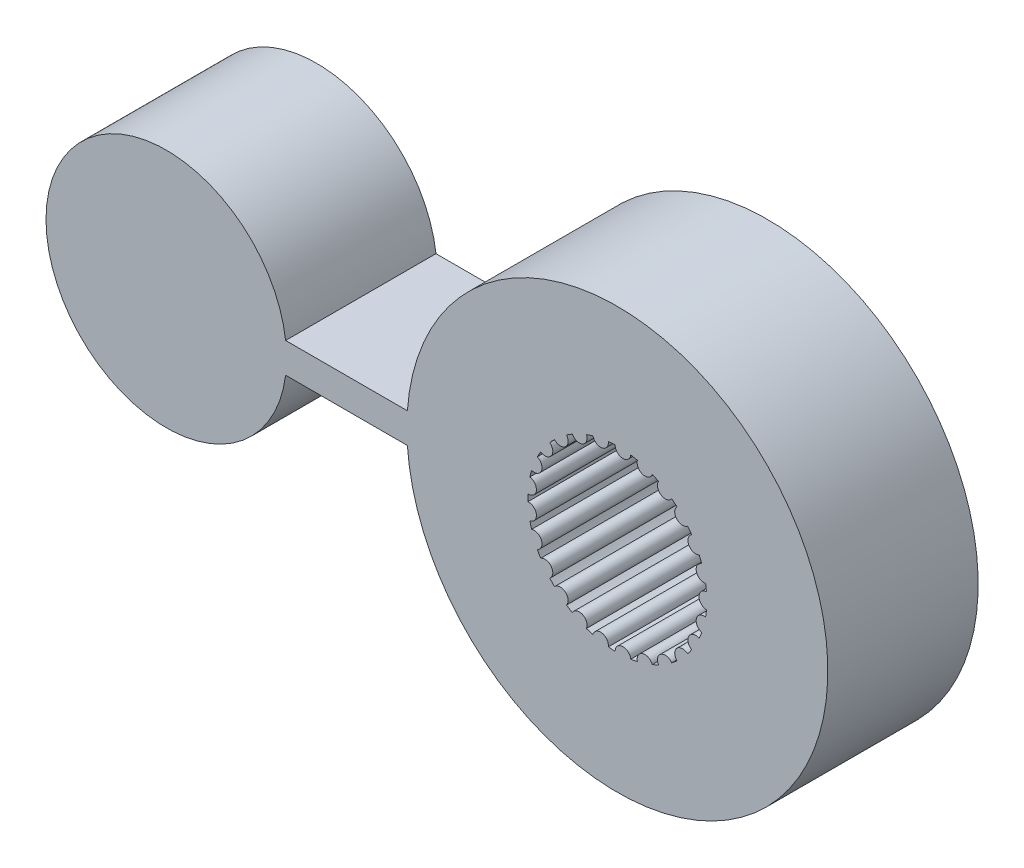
from build123d import *

# Parameters (mm, degrees)
ESQUISSE1_R        = 2.975
BOSS_EXTRU_1_DEPTH = 5
ESQUISSE2_R        = 0.26
BOSS_EXTRU_2_DEPTH = 5


with BuildPart() as part:
    # Esquisse1 → Boss.-Extru.1 (new body)
    with BuildSketch(Plane.XY):
        with BuildLine():
            Line((-11.031373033, 0.5), (-6.982120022, 0.5))
            ThreePointArc((-6.982120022, 0.5), (7, 0), (-6.982120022, -0.5))
            Line((-6.982120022, -0.5), (-11.031373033, -0.5))
            ThreePointArc((-11.031373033, -0.5), (-19, 0), (-11.031373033, 0.5))
        make_face()
        Circle(ESQUISSE1_R, mode=Mode.SUBTRACT)
    extrude(amount=BOSS_EXTRU_1_DEPTH)

    # Esquisse2 → Boss.-Extru.2 (add)
    with BuildSketch(Plane.XY.offset(5)):
        with Locations((2.975, 0)):
            Circle(ESQUISSE2_R)
        with Locations((2.881534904, -0.739852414)):
            Circle(ESQUISSE2_R)
        with Locations((2.607012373, -1.43321718)):
            Circle(ESQUISSE2_R)
        with Locations((2.168681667, -2.03652764)):
            Circle(ESQUISSE2_R)
        with Locations((1.594084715, -2.511875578)):
            Circle(ESQUISSE2_R)
        with Locations((0.919325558, -2.829393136)):
            Circle(ESQUISSE2_R)
        with Locations((0.186801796, -2.969129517)):
            Circle(ESQUISSE2_R)
        with Locations((-0.557459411, -2.922304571)):
            Circle(ESQUISSE2_R)
        with Locations((-1.266693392, -2.691860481)):
            Circle(ESQUISSE2_R)
        with Locations((-1.89633637, -2.292276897)):
            Circle(ESQUISSE2_R)
        with Locations((-2.406825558, -1.748661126)):
            Circle(ESQUISSE2_R)
        with Locations((-2.766085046, -1.095170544)):
            Circle(ESQUISSE2_R)
        with Locations((-2.951541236, -0.37286637)):
            Circle(ESQUISSE2_R)
        with Locations((-2.951541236, 0.37286637)):
            Circle(ESQUISSE2_R)
        with Locations((-2.766085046, 1.095170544)):
            Circle(ESQUISSE2_R)
        with Locations((-2.406825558, 1.748661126)):
            Circle(ESQUISSE2_R)
        with Locations((-1.89633637, 2.292276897)):
            Circle(ESQUISSE2_R)
        with Locations((-1.266693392, 2.691860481)):
            Circle(ESQUISSE2_R)
        with Locations((-0.557459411, 2.922304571)):
            Circle(ESQUISSE2_R)
        with Locations((0.186801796, 2.969129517)):
            Circle(ESQUISSE2_R)
        with Locations((0.919325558, 2.829393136)):
            Circle(ESQUISSE2_R)
        with Locations((1.594084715, 2.511875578)):
            Circle(ESQUISSE2_R)
        with Locations((2.168681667, 2.03652764)):
            Circle(ESQUISSE2_R)
        with Locations((2.607012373, 1.43321718)):
            Circle(ESQUISSE2_R)
        with Locations((2.881534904, 0.739852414)):
            Circle(ESQUISSE2_R)
    extrude(amount=-BOSS_EXTRU_2_DEPTH)


solid = part.part
